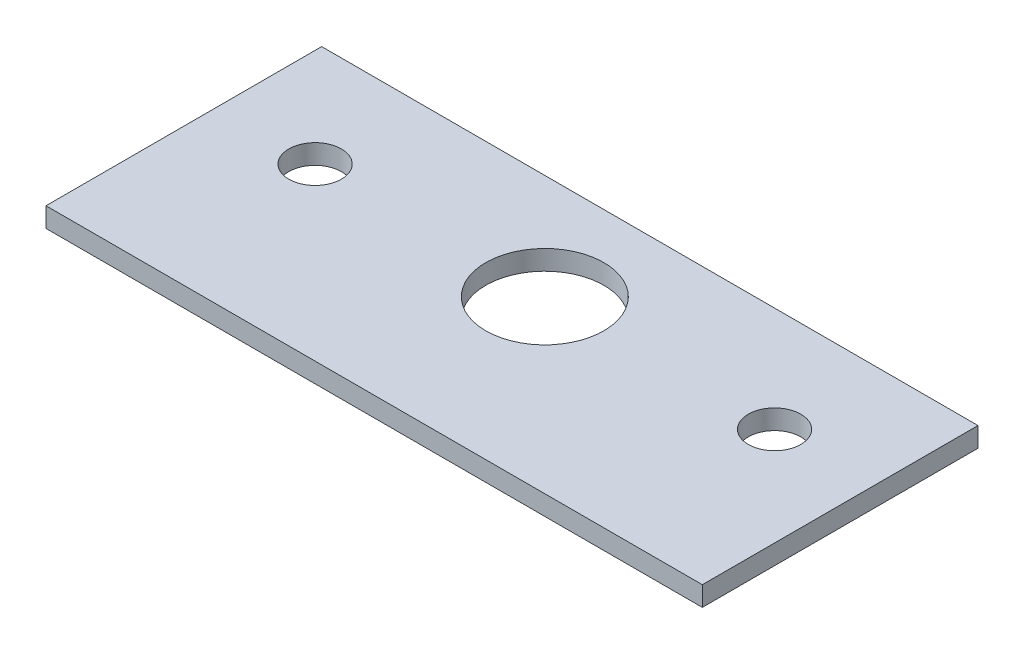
from build123d import *

# Parameters (mm, degrees)
ESQUISSE1_W      = 100
ESQUISSE1_H      = 42
ESQUISSE1_R      = 9
ESQUISSE1_R_2    = 4
EXTRUSION1_DEPTH = 3


with BuildPart() as part:
    # Esquisse1 → Extrusion1 (new body)
    with BuildSketch(Plane(origin=(0, 0, 0), x_dir=(1, 0, 0), z_dir=(0, 1, 0))):
        Rectangle(ESQUISSE1_W, ESQUISSE1_H)
        with Locations(Location((0, 5, 0), (0, 0, 270))):
            Circle(ESQUISSE1_R, mode=Mode.SUBTRACT)
        with Locations(Location((35, 5, 0), (0, 0, 270))):
            Circle(ESQUISSE1_R_2, mode=Mode.SUBTRACT)
        with Locations(Location((-35, 5, 0), (0, 0, 270))):
            Circle(ESQUISSE1_R_2, mode=Mode.SUBTRACT)
    extrude(amount=EXTRUSION1_DEPTH)


solid = part.part
